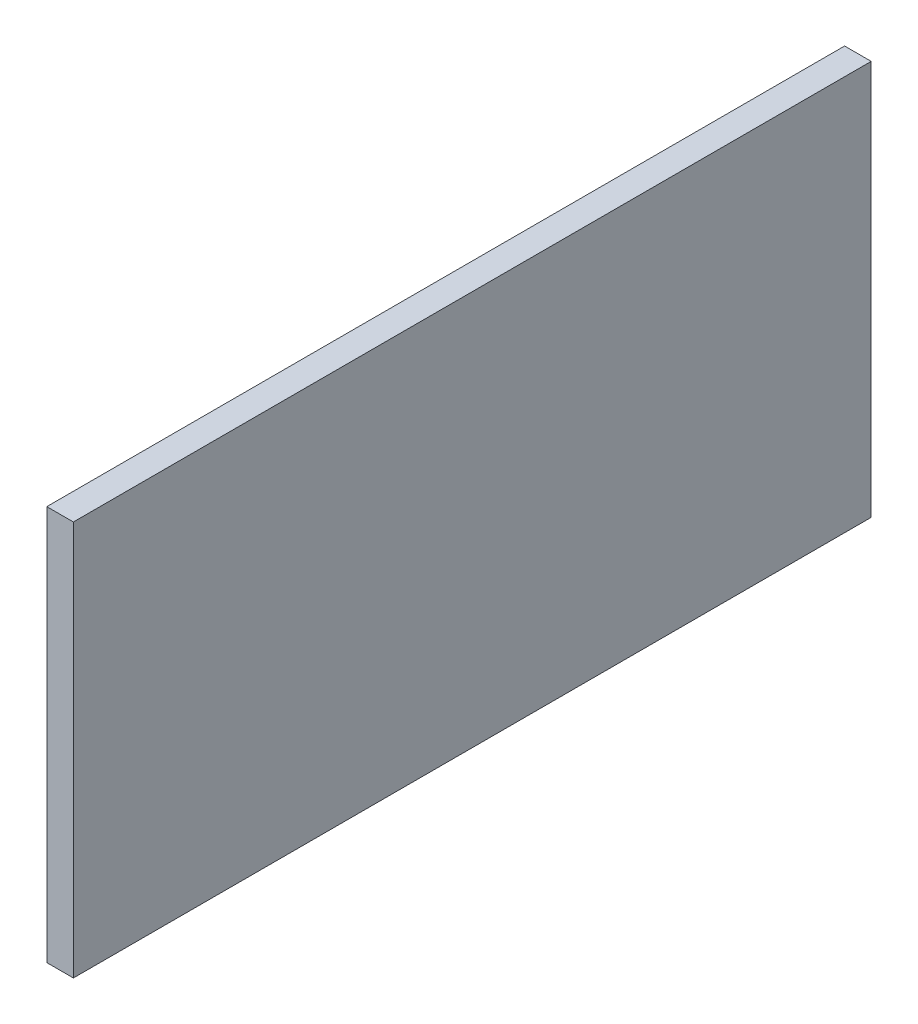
from build123d import *

# Parameters (mm, degrees)
CROQUIS1_W              = 1200
CROQUIS1_H              = 594
SALIENTE_EXTRUIR1_DEPTH = 40


with BuildPart() as part:
    # Croquis1 → Saliente-Extruir1 (new body)
    with BuildSketch(Plane(origin=(0, 0, 0), x_dir=(0, 0, -1), z_dir=(1, 0, 0))):
        with Locations((600, 297)):
            Rectangle(CROQUIS1_W, CROQUIS1_H)
    extrude(amount=SALIENTE_EXTRUIR1_DEPTH)


solid = part.part
